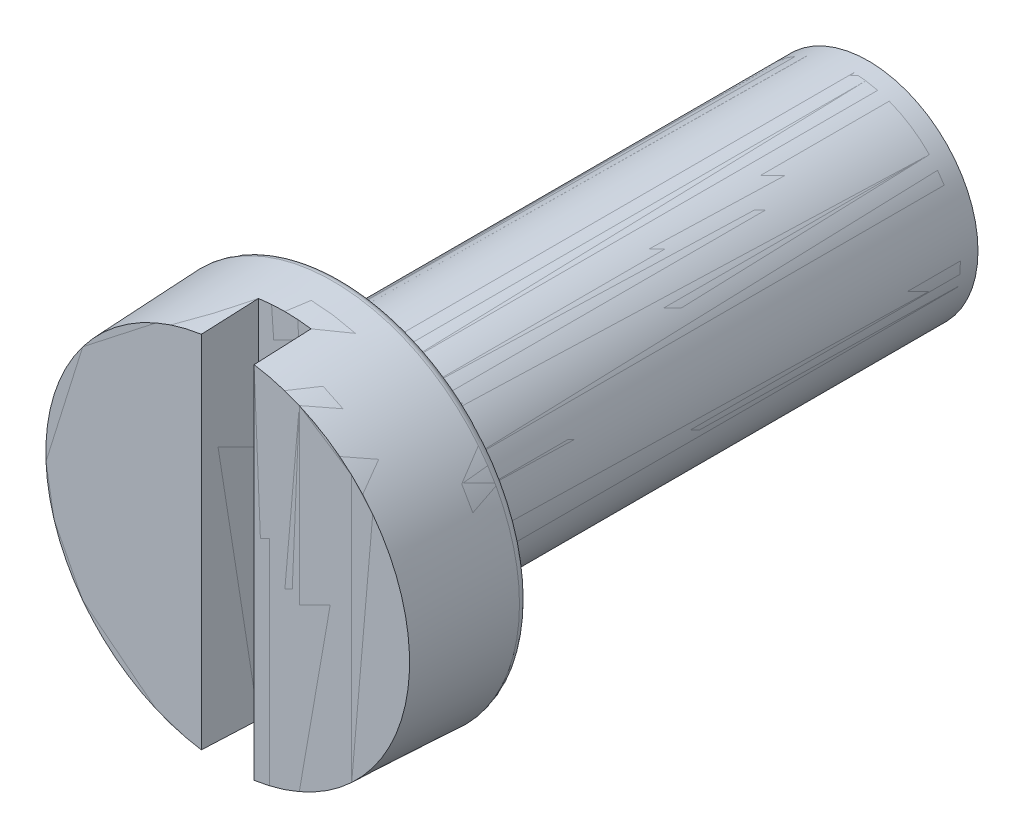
ISO-10303-21;
HEADER;
FILE_DESCRIPTION(('STEP AP214'),'2;1');
FILE_NAME('part.step','',(''),(''),'','','');
FILE_SCHEMA(('AUTOMOTIVE_DESIGN { 1 0 10303 214 1 1 1 1 }'));
ENDSEC;
DATA;
#1=APPLICATION_CONTEXT('core data for automotive mechanical design processes');
#2=APPLICATION_PROTOCOL_DEFINITION('international standard','automotive_design',2000,#1);
#3=PRODUCT_CONTEXT('',#1,'mechanical');
#4=PRODUCT('Part','Part','',(#3));
#5=PRODUCT_RELATED_PRODUCT_CATEGORY('part','',(#4));
#6=PRODUCT_DEFINITION_FORMATION('','',#4);
#7=PRODUCT_DEFINITION_CONTEXT('part definition',#1,'design');
#8=PRODUCT_DEFINITION('design','',#6,#7);
#9=PRODUCT_DEFINITION_SHAPE('','',#8);
#10=(LENGTH_UNIT() NAMED_UNIT(*) SI_UNIT(.MILLI.,.METRE.));
#11=(NAMED_UNIT(*) PLANE_ANGLE_UNIT() SI_UNIT($,.RADIAN.));
#12=(NAMED_UNIT(*) SI_UNIT($,.STERADIAN.) SOLID_ANGLE_UNIT());
#13=UNCERTAINTY_MEASURE_WITH_UNIT(LENGTH_MEASURE(1.E-05),#10,'distance_accuracy_value','');
#14=(GEOMETRIC_REPRESENTATION_CONTEXT(3) GLOBAL_UNCERTAINTY_ASSIGNED_CONTEXT((#13)) GLOBAL_UNIT_ASSIGNED_CONTEXT((#10,
#11,#12)) REPRESENTATION_CONTEXT('',''));
#15=CARTESIAN_POINT('',(0.,0.,0.));
#16=DIRECTION('',(0.,0.,1.));
#17=DIRECTION('',(1.,0.,0.));
#18=AXIS2_PLACEMENT_3D('',#15,#16,#17);
#19=CARTESIAN_POINT('',(0.,0.,2.6));
#20=DIRECTION('',(0.,0.,1.));
#21=DIRECTION('',(1.,0.,0.));
#22=AXIS2_PLACEMENT_3D('',#19,#20,#21);
#23=PLANE('',#22);
#24=DIRECTION('',(0.,1.,0.));
#25=VECTOR('',#24,1.);
#26=CARTESIAN_POINT('',(0.6,0.,2.6));
#27=LINE('',#26,#25);
#28=CARTESIAN_POINT('',(0.6,-4.10156030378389,2.6));
#29=VERTEX_POINT('',#28);
#30=CARTESIAN_POINT('',(0.6,4.10156030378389,2.6));
#31=VERTEX_POINT('',#30);
#32=EDGE_CURVE('P0_E51',#29,#31,#27,.T.);
#33=ORIENTED_EDGE('',*,*,#32,.F.);
#34=CARTESIAN_POINT('',(0.,0.,2.6));
#35=DIRECTION('',(0.,0.,1.));
#36=DIRECTION('',(1.,0.,0.));
#37=AXIS2_PLACEMENT_3D('',#34,#35,#36);
#38=CIRCLE('',#37,4.14521373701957);
#39=EDGE_CURVE('P0_E139',#29,#31,#38,.T.);
#40=ORIENTED_EDGE('',*,*,#39,.T.);
#41=EDGE_LOOP('',(#33,#40));
#42=FACE_BOUND('',#41,.T.);
#43=ADVANCED_FACE('P0_F28',(#42),#23,.T.);
#44=DIRECTION('',(0.,-1.,0.));
#45=VECTOR('',#44,1.);
#46=CARTESIAN_POINT('',(-0.6,0.,2.6));
#47=LINE('',#46,#45);
#48=CARTESIAN_POINT('',(-0.6,4.10156030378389,2.6));
#49=VERTEX_POINT('',#48);
#50=CARTESIAN_POINT('',(-0.6,-4.10156030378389,2.6));
#51=VERTEX_POINT('',#50);
#52=EDGE_CURVE('P0_E84',#49,#51,#47,.T.);
#53=ORIENTED_EDGE('',*,*,#52,.F.);
#54=EDGE_CURVE('P0_E90',#49,#51,#38,.T.);
#55=ORIENTED_EDGE('',*,*,#54,.T.);
#56=EDGE_LOOP('',(#53,#55));
#57=FACE_BOUND('',#56,.T.);
#58=ADVANCED_FACE('P0_F30',(#57),#23,.T.);
#59=CARTESIAN_POINT('',(0.,0.,-12.));
#60=DIRECTION('',(0.,0.,1.));
#61=DIRECTION('',(1.,0.,0.));
#62=AXIS2_PLACEMENT_3D('',#59,#60,#61);
#63=PLANE('',#62);
#64=CARTESIAN_POINT('',(0.,0.,-12.));
#65=DIRECTION('',(0.,0.,1.));
#66=DIRECTION('',(1.,0.,0.));
#67=AXIS2_PLACEMENT_3D('',#64,#65,#66);
#68=CIRCLE('',#67,2.1);
#69=CARTESIAN_POINT('',(2.1,0.,-12.));
#70=VERTEX_POINT('',#69);
#71=EDGE_CURVE('P0_E11',#70,#70,#68,.F.);
#72=ORIENTED_EDGE('',*,*,#71,.T.);
#73=EDGE_LOOP('',(#72));
#74=FACE_BOUND('',#73,.T.);
#75=ADVANCED_FACE('P0_F147',(#74),#63,.F.);
#76=CARTESIAN_POINT('',(0.,0.,0.));
#77=DIRECTION('',(0.,0.,1.));
#78=DIRECTION('',(1.,0.,0.));
#79=AXIS2_PLACEMENT_3D('',#76,#77,#78);
#80=CYLINDRICAL_SURFACE('',#79,2.5);
#81=CARTESIAN_POINT('',(0.,0.,-11.6));
#82=DIRECTION('',(0.,0.,1.));
#83=DIRECTION('',(1.,0.,0.));
#84=AXIS2_PLACEMENT_3D('',#81,#82,#83);
#85=CIRCLE('',#84,2.5);
#86=CARTESIAN_POINT('',(2.5,0.,-11.6));
#87=VERTEX_POINT('',#86);
#88=EDGE_CURVE('P0_E36',#87,#87,#85,.T.);
#89=ORIENTED_EDGE('',*,*,#88,.T.);
#90=EDGE_LOOP('',(#89));
#91=FACE_BOUND('',#90,.T.);
#92=CARTESIAN_POINT('',(0.,0.,-0.433));
#93=DIRECTION('',(0.,0.,1.));
#94=DIRECTION('',(1.,0.,0.));
#95=AXIS2_PLACEMENT_3D('',#92,#93,#94);
#96=CIRCLE('',#95,2.5);
#97=CARTESIAN_POINT('',(2.5,0.,-0.433));
#98=VERTEX_POINT('',#97);
#99=EDGE_CURVE('P0_E121',#98,#98,#96,.T.);
#100=ORIENTED_EDGE('',*,*,#99,.F.);
#101=EDGE_LOOP('',(#100));
#102=FACE_BOUND('',#101,.T.);
#103=ADVANCED_FACE('P0_F152',(#91,#102),#80,.T.);
#104=CARTESIAN_POINT('',(0.,0.,-0.433));
#105=DIRECTION('',(0.,0.,1.));
#106=DIRECTION('',(1.,0.,0.));
#107=AXIS2_PLACEMENT_3D('',#104,#105,#106);
#108=TOROIDAL_SURFACE('',#107,2.7,0.2);
#109=ORIENTED_EDGE('',*,*,#99,.T.);
#110=EDGE_LOOP('',(#109));
#111=FACE_BOUND('',#110,.T.);
#112=CARTESIAN_POINT('',(0.,0.,-0.324739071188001));
#113=DIRECTION('',(0.,0.,1.));
#114=DIRECTION('',(1.,0.,0.));
#115=AXIS2_PLACEMENT_3D('',#112,#113,#114);
#116=CIRCLE('',#115,2.5318346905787);
#117=CARTESIAN_POINT('',(2.5318346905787,0.,-0.324739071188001));
#118=VERTEX_POINT('',#117);
#119=EDGE_CURVE('P0_E124',#118,#118,#116,.T.);
#120=ORIENTED_EDGE('',*,*,#119,.F.);
#121=EDGE_LOOP('',(#120));
#122=FACE_BOUND('',#121,.T.);
#123=ADVANCED_FACE('P0_F185',(#111,#122),#108,.F.);
#124=CARTESIAN_POINT('',(0.,0.,-0.324739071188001));
#125=DIRECTION('',(0.,0.,1.));
#126=DIRECTION('',(1.,0.,0.));
#127=AXIS2_PLACEMENT_3D('',#124,#125,#126);
#128=CONICAL_SURFACE('',#127,2.5318346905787,0.571987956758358);
#129=CARTESIAN_POINT('',(0.,0.,-0.0917390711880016));
#130=DIRECTION('',(0.,0.,1.));
#131=DIRECTION('',(1.,0.,0.));
#132=AXIS2_PLACEMENT_3D('',#129,#130,#131);
#133=CIRCLE('',#132,2.68183469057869);
#134=CARTESIAN_POINT('',(2.68183469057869,0.,-0.0917390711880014));
#135=VERTEX_POINT('',#134);
#136=EDGE_CURVE('P0_E127',#135,#135,#133,.T.);
#137=ORIENTED_EDGE('',*,*,#136,.F.);
#138=EDGE_LOOP('',(#137));
#139=FACE_BOUND('',#138,.T.);
#140=ORIENTED_EDGE('',*,*,#119,.T.);
#141=EDGE_LOOP('',(#140));
#142=FACE_BOUND('',#141,.T.);
#143=ADVANCED_FACE('P0_F181',(#139,#142),#128,.T.);
#144=CARTESIAN_POINT('',(0.,0.,-0.2));
#145=DIRECTION('',(0.,0.,1.));
#146=DIRECTION('',(1.,0.,0.));
#147=AXIS2_PLACEMENT_3D('',#144,#145,#146);
#148=TOROIDAL_SURFACE('',#147,2.85,0.2);
#149=ORIENTED_EDGE('',*,*,#136,.T.);
#150=EDGE_LOOP('',(#149));
#151=FACE_BOUND('',#150,.T.);
#152=CARTESIAN_POINT('',(0.,0.,0.));
#153=DIRECTION('',(0.,0.,1.));
#154=DIRECTION('',(1.,0.,0.));
#155=AXIS2_PLACEMENT_3D('',#152,#153,#154);
#156=CIRCLE('',#155,2.85);
#157=CARTESIAN_POINT('',(2.85,0.,0.));
#158=VERTEX_POINT('',#157);
#159=EDGE_CURVE('P0_E130',#158,#158,#156,.T.);
#160=ORIENTED_EDGE('',*,*,#159,.F.);
#161=EDGE_LOOP('',(#160));
#162=FACE_BOUND('',#161,.T.);
#163=ADVANCED_FACE('P0_F173',(#151,#162),#148,.F.);
#164=CARTESIAN_POINT('',(0.,2.85,0.));
#165=DIRECTION('',(0.,0.,1.));
#166=DIRECTION('',(1.,0.,0.));
#167=AXIS2_PLACEMENT_3D('',#164,#165,#166);
#168=PLANE('',#167);
#169=CARTESIAN_POINT('',(0.,0.,0.));
#170=DIRECTION('',(0.,0.,1.));
#171=DIRECTION('',(1.,0.,0.));
#172=AXIS2_PLACEMENT_3D('',#169,#170,#171);
#173=CIRCLE('',#172,4.05);
#174=CARTESIAN_POINT('',(4.05,0.,0.));
#175=VERTEX_POINT('',#174);
#176=EDGE_CURVE('P0_E133',#175,#175,#173,.T.);
#177=ORIENTED_EDGE('',*,*,#176,.F.);
#178=EDGE_LOOP('',(#177));
#179=FACE_BOUND('',#178,.T.);
#180=ORIENTED_EDGE('',*,*,#159,.T.);
#181=EDGE_LOOP('',(#180));
#182=FACE_BOUND('',#181,.T.);
#183=ADVANCED_FACE('P0_F168',(#179,#182),#168,.F.);
#184=CARTESIAN_POINT('',(0.,0.,0.2));
#185=DIRECTION('',(0.,0.,1.));
#186=DIRECTION('',(1.,0.,0.));
#187=AXIS2_PLACEMENT_3D('',#184,#185,#186);
#188=TOROIDAL_SURFACE('',#187,4.05,0.2);
#189=CARTESIAN_POINT('',(0.,0.,0.2));
#190=DIRECTION('',(0.,0.,1.));
#191=DIRECTION('',(1.,0.,0.));
#192=AXIS2_PLACEMENT_3D('',#189,#190,#191);
#193=CIRCLE('',#192,4.25);
#194=CARTESIAN_POINT('',(4.25,0.,0.2));
#195=VERTEX_POINT('',#194);
#196=EDGE_CURVE('P0_E136',#195,#195,#193,.T.);
#197=ORIENTED_EDGE('',*,*,#196,.F.);
#198=EDGE_LOOP('',(#197));
#199=FACE_BOUND('',#198,.T.);
#200=ORIENTED_EDGE('',*,*,#176,.T.);
#201=EDGE_LOOP('',(#200));
#202=FACE_BOUND('',#201,.T.);
#203=ADVANCED_FACE('P0_F162',(#199,#202),#188,.T.);
#204=CARTESIAN_POINT('',(0.,0.,0.2));
#205=DIRECTION('',(0.,0.,-1.));
#206=DIRECTION('',(-1.,0.,0.));
#207=AXIS2_PLACEMENT_3D('',#204,#205,#206);
#208=CONICAL_SURFACE('',#207,4.25,0.0436332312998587);
#209=CARTESIAN_POINT('',(0.,0.,1.3));
#210=DIRECTION('',(0.,0.,-1.));
#211=DIRECTION('',(-1.,0.,0.));
#212=AXIS2_PLACEMENT_3D('',#209,#210,#211);
#213=CIRCLE('',#212,4.20197296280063);
#214=CARTESIAN_POINT('',(-0.6,4.1589153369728,1.3));
#215=VERTEX_POINT('',#214);
#216=CARTESIAN_POINT('',(0.6,4.1589153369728,1.3));
#217=VERTEX_POINT('',#216);
#218=EDGE_CURVE('P0_E68',#215,#217,#213,.T.);
#219=ORIENTED_EDGE('',*,*,#218,.T.);
#220=CARTESIAN_POINT('',(0.6,4.48049536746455,-5.99526208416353));
#221=CARTESIAN_POINT('',(0.6,4.3632332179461,-3.33290690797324));
#222=CARTESIAN_POINT('',(0.6,4.24586680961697,-0.67055633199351));
#223=CARTESIAN_POINT('',(0.6,4.01092547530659,4.65413562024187));
#224=CARTESIAN_POINT('',(0.6,3.89335054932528,7.31647699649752));
#225=CARTESIAN_POINT('',(0.6,3.77567136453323,9.97881377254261));
#226=B_SPLINE_CURVE_WITH_KNOTS('',3,(#220,#221,#222,#223,#224,#225),.UNSPECIFIED.,.F.,.F.,(4,2,
4),(0.,7.99480888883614,15.9896177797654),.UNSPECIFIED.);
#227=EDGE_CURVE('P0_E91',#217,#31,#226,.T.);
#228=ORIENTED_EDGE('',*,*,#227,.T.);
#229=ORIENTED_EDGE('',*,*,#39,.F.);
#230=CARTESIAN_POINT('',(0.6,-3.77567136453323,9.97881377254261));
#231=CARTESIAN_POINT('',(0.6,-3.89335054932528,7.31647699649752));
#232=CARTESIAN_POINT('',(0.6,-4.01092547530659,4.65413562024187));
#233=CARTESIAN_POINT('',(0.6,-4.24586680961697,-0.67055633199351));
#234=CARTESIAN_POINT('',(0.6,-4.3632332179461,-3.33290690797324));
#235=CARTESIAN_POINT('',(0.6,-4.48049536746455,-5.99526208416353));
#236=B_SPLINE_CURVE_WITH_KNOTS('',3,(#230,#231,#232,#233,#234,#235),.UNSPECIFIED.,.F.,.F.,(4,2,
4),(0.,7.99480889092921,15.9896177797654),.UNSPECIFIED.);
#237=CARTESIAN_POINT('',(0.6,-4.1589153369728,1.3));
#238=VERTEX_POINT('',#237);
#239=EDGE_CURVE('P0_E75',#29,#238,#236,.T.);
#240=ORIENTED_EDGE('',*,*,#239,.T.);
#241=CARTESIAN_POINT('',(-0.6,-4.1589153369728,1.3));
#242=VERTEX_POINT('',#241);
#243=EDGE_CURVE('P0_E77',#238,#242,#213,.T.);
#244=ORIENTED_EDGE('',*,*,#243,.T.);
#245=CARTESIAN_POINT('',(-0.6,-4.48049536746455,-5.99526208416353));
#246=CARTESIAN_POINT('',(-0.6,-4.3632332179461,-3.33290690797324));
#247=CARTESIAN_POINT('',(-0.6,-4.24586680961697,-0.67055633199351));
#248=CARTESIAN_POINT('',(-0.6,-4.01092547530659,4.65413562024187));
#249=CARTESIAN_POINT('',(-0.6,-3.89335054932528,7.31647699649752));
#250=CARTESIAN_POINT('',(-0.6,-3.77567136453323,9.97881377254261));
#251=B_SPLINE_CURVE_WITH_KNOTS('',3,(#245,#246,#247,#248,#249,#250),.UNSPECIFIED.,.F.,.F.,(4,2,
4),(0.,7.99480888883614,15.9896177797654),.UNSPECIFIED.);
#252=EDGE_CURVE('P0_E82',#242,#51,#251,.T.);
#253=ORIENTED_EDGE('',*,*,#252,.T.);
#254=ORIENTED_EDGE('',*,*,#54,.F.);
#255=CARTESIAN_POINT('',(-0.6,3.77567136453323,9.97881377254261));
#256=CARTESIAN_POINT('',(-0.6,3.89335054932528,7.31647699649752));
#257=CARTESIAN_POINT('',(-0.6,4.01092547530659,4.65413562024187));
#258=CARTESIAN_POINT('',(-0.6,4.24586680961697,-0.67055633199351));
#259=CARTESIAN_POINT('',(-0.6,4.3632332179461,-3.33290690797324));
#260=CARTESIAN_POINT('',(-0.6,4.48049536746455,-5.99526208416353));
#261=B_SPLINE_CURVE_WITH_KNOTS('',3,(#255,#256,#257,#258,#259,#260),.UNSPECIFIED.,.F.,.F.,(4,2,
4),(0.,7.99480889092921,15.9896177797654),.UNSPECIFIED.);
#262=EDGE_CURVE('P0_E74',#49,#215,#261,.T.);
#263=ORIENTED_EDGE('',*,*,#262,.T.);
#264=EDGE_LOOP('',(#219,#228,#229,#240,#244,#253,#254,#263));
#265=FACE_BOUND('',#264,.T.);
#266=ORIENTED_EDGE('',*,*,#196,.T.);
#267=EDGE_LOOP('',(#266));
#268=FACE_BOUND('',#267,.T.);
#269=ADVANCED_FACE('P0_F87',(#265,#268),#208,.T.);
#270=CARTESIAN_POINT('',(0.6,0.,1.95));
#271=DIRECTION('',(1.,0.,0.));
#272=DIRECTION('',(0.,0.,-1.));
#273=AXIS2_PLACEMENT_3D('',#270,#271,#272);
#274=PLANE('',#273);
#275=ORIENTED_EDGE('',*,*,#32,.T.);
#276=ORIENTED_EDGE('',*,*,#227,.F.);
#277=DIRECTION('',(0.,-1.,0.));
#278=VECTOR('',#277,1.);
#279=CARTESIAN_POINT('',(0.6,0.,1.3));
#280=LINE('',#279,#278);
#281=EDGE_CURVE('P0_E71',#217,#238,#280,.T.);
#282=ORIENTED_EDGE('',*,*,#281,.T.);
#283=ORIENTED_EDGE('',*,*,#239,.F.);
#284=EDGE_LOOP('',(#275,#276,#282,#283));
#285=FACE_BOUND('',#284,.T.);
#286=ADVANCED_FACE('P0_F114',(#285),#274,.F.);
#287=CARTESIAN_POINT('',(-0.6,0.,1.95));
#288=DIRECTION('',(-1.,0.,0.));
#289=DIRECTION('',(0.,0.,1.));
#290=AXIS2_PLACEMENT_3D('',#287,#288,#289);
#291=PLANE('',#290);
#292=DIRECTION('',(0.,1.,0.));
#293=VECTOR('',#292,1.);
#294=CARTESIAN_POINT('',(-0.6,0.,1.3));
#295=LINE('',#294,#293);
#296=EDGE_CURVE('P0_E43',#242,#215,#295,.T.);
#297=ORIENTED_EDGE('',*,*,#296,.T.);
#298=ORIENTED_EDGE('',*,*,#262,.F.);
#299=ORIENTED_EDGE('',*,*,#52,.T.);
#300=ORIENTED_EDGE('',*,*,#252,.F.);
#301=EDGE_LOOP('',(#297,#298,#299,#300));
#302=FACE_BOUND('',#301,.T.);
#303=ADVANCED_FACE('P0_F79',(#302),#291,.F.);
#304=CARTESIAN_POINT('',(-0.6,0.,1.3));
#305=DIRECTION('',(0.,0.,-1.));
#306=DIRECTION('',(-1.,0.,0.));
#307=AXIS2_PLACEMENT_3D('',#304,#305,#306);
#308=PLANE('',#307);
#309=ORIENTED_EDGE('',*,*,#296,.F.);
#310=ORIENTED_EDGE('',*,*,#243,.F.);
#311=ORIENTED_EDGE('',*,*,#281,.F.);
#312=ORIENTED_EDGE('',*,*,#218,.F.);
#313=EDGE_LOOP('',(#309,#310,#311,#312));
#314=FACE_BOUND('',#313,.T.);
#315=ADVANCED_FACE('P0_F69',(#314),#308,.F.);
#316=CARTESIAN_POINT('',(0.,0.,-11.6));
#317=DIRECTION('',(0.,0.,1.));
#318=DIRECTION('',(1.,0.,0.));
#319=AXIS2_PLACEMENT_3D('',#316,#317,#318);
#320=CONICAL_SURFACE('',#319,2.5,0.785398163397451);
#321=ORIENTED_EDGE('',*,*,#71,.F.);
#322=EDGE_LOOP('',(#321));
#323=FACE_BOUND('',#322,.T.);
#324=ORIENTED_EDGE('',*,*,#88,.F.);
#325=EDGE_LOOP('',(#324));
#326=FACE_BOUND('',#325,.T.);
#327=ADVANCED_FACE('P0_F115',(#323,#326),#320,.T.);
#328=CLOSED_SHELL('',(#43,#58,#75,#103,#123,#143,#163,#183,#203,#269,#286,#303,#315,#327));
#329=MANIFOLD_SOLID_BREP('P0_B2',#328);
#330=CARTESIAN_POINT('',(0.,0.,2.6));
#331=DIRECTION('',(0.,0.,1.));
#332=DIRECTION('',(1.,0.,0.));
#333=AXIS2_PLACEMENT_3D('',#330,#331,#332);
#334=PLANE('',#333);
#335=DIRECTION('',(0.,1.,0.));
#336=VECTOR('',#335,1.);
#337=CARTESIAN_POINT('',(0.6,0.,2.6));
#338=LINE('',#337,#336);
#339=CARTESIAN_POINT('',(0.6,-4.10156030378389,2.6));
#340=VERTEX_POINT('',#339);
#341=CARTESIAN_POINT('',(0.6,4.10156030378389,2.6));
#342=VERTEX_POINT('',#341);
#343=EDGE_CURVE('P1_E44',#340,#342,#338,.T.);
#344=ORIENTED_EDGE('',*,*,#343,.F.);
#345=CARTESIAN_POINT('',(0.,0.,2.6));
#346=DIRECTION('',(0.,0.,1.));
#347=DIRECTION('',(1.,0.,0.));
#348=AXIS2_PLACEMENT_3D('',#345,#346,#347);
#349=CIRCLE('',#348,4.14521373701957);
#350=EDGE_CURVE('P1_E123',#340,#342,#349,.T.);
#351=ORIENTED_EDGE('',*,*,#350,.T.);
#352=EDGE_LOOP('',(#344,#351));
#353=FACE_BOUND('',#352,.T.);
#354=ADVANCED_FACE('P1_F16',(#353),#334,.T.);
#355=DIRECTION('',(0.,-1.,0.));
#356=VECTOR('',#355,1.);
#357=CARTESIAN_POINT('',(-0.6,0.,2.6));
#358=LINE('',#357,#356);
#359=CARTESIAN_POINT('',(-0.6,4.10156030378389,2.6));
#360=VERTEX_POINT('',#359);
#361=CARTESIAN_POINT('',(-0.6,-4.10156030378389,2.6));
#362=VERTEX_POINT('',#361);
#363=EDGE_CURVE('P1_E75',#360,#362,#358,.T.);
#364=ORIENTED_EDGE('',*,*,#363,.F.);
#365=EDGE_CURVE('P1_E81',#360,#362,#349,.T.);
#366=ORIENTED_EDGE('',*,*,#365,.T.);
#367=EDGE_LOOP('',(#364,#366));
#368=FACE_BOUND('',#367,.T.);
#369=ADVANCED_FACE('P1_F18',(#368),#334,.T.);
#370=CARTESIAN_POINT('',(0.,0.,-12.));
#371=DIRECTION('',(0.,0.,1.));
#372=DIRECTION('',(1.,0.,0.));
#373=AXIS2_PLACEMENT_3D('',#370,#371,#372);
#374=PLANE('',#373);
#375=CARTESIAN_POINT('',(0.,0.,-12.));
#376=DIRECTION('',(0.,0.,1.));
#377=DIRECTION('',(1.,0.,0.));
#378=AXIS2_PLACEMENT_3D('',#375,#376,#377);
#379=CIRCLE('',#378,2.5);
#380=CARTESIAN_POINT('',(2.5,0.,-12.));
#381=VERTEX_POINT('',#380);
#382=EDGE_CURVE('P1_E102',#381,#381,#379,.T.);
#383=ORIENTED_EDGE('',*,*,#382,.F.);
#384=EDGE_LOOP('',(#383));
#385=FACE_BOUND('',#384,.T.);
#386=ADVANCED_FACE('P1_F131',(#385),#374,.F.);
#387=CARTESIAN_POINT('',(0.,0.,0.));
#388=DIRECTION('',(0.,0.,1.));
#389=DIRECTION('',(1.,0.,0.));
#390=AXIS2_PLACEMENT_3D('',#387,#388,#389);
#391=CYLINDRICAL_SURFACE('',#390,2.5);
#392=CARTESIAN_POINT('',(0.,0.,-0.433));
#393=DIRECTION('',(0.,0.,1.));
#394=DIRECTION('',(1.,0.,0.));
#395=AXIS2_PLACEMENT_3D('',#392,#393,#394);
#396=CIRCLE('',#395,2.5);
#397=CARTESIAN_POINT('',(2.5,0.,-0.433));
#398=VERTEX_POINT('',#397);
#399=EDGE_CURVE('P1_E105',#398,#398,#396,.T.);
#400=ORIENTED_EDGE('',*,*,#399,.F.);
#401=EDGE_LOOP('',(#400));
#402=FACE_BOUND('',#401,.T.);
#403=ORIENTED_EDGE('',*,*,#382,.T.);
#404=EDGE_LOOP('',(#403));
#405=FACE_BOUND('',#404,.T.);
#406=ADVANCED_FACE('P1_F137',(#402,#405),#391,.T.);
#407=CARTESIAN_POINT('',(0.,0.,-0.433));
#408=DIRECTION('',(0.,0.,1.));
#409=DIRECTION('',(1.,0.,0.));
#410=AXIS2_PLACEMENT_3D('',#407,#408,#409);
#411=TOROIDAL_SURFACE('',#410,2.7,0.2);
#412=ORIENTED_EDGE('',*,*,#399,.T.);
#413=EDGE_LOOP('',(#412));
#414=FACE_BOUND('',#413,.T.);
#415=CARTESIAN_POINT('',(0.,0.,-0.324739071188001));
#416=DIRECTION('',(0.,0.,1.));
#417=DIRECTION('',(1.,0.,0.));
#418=AXIS2_PLACEMENT_3D('',#415,#416,#417);
#419=CIRCLE('',#418,2.5318346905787);
#420=CARTESIAN_POINT('',(2.5318346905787,0.,-0.324739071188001));
#421=VERTEX_POINT('',#420);
#422=EDGE_CURVE('P1_E108',#421,#421,#419,.T.);
#423=ORIENTED_EDGE('',*,*,#422,.F.);
#424=EDGE_LOOP('',(#423));
#425=FACE_BOUND('',#424,.T.);
#426=ADVANCED_FACE('P1_F170',(#414,#425),#411,.F.);
#427=CARTESIAN_POINT('',(0.,0.,-0.324739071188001));
#428=DIRECTION('',(0.,0.,1.));
#429=DIRECTION('',(1.,0.,0.));
#430=AXIS2_PLACEMENT_3D('',#427,#428,#429);
#431=CONICAL_SURFACE('',#430,2.5318346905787,0.571987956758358);
#432=CARTESIAN_POINT('',(0.,0.,-0.0917390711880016));
#433=DIRECTION('',(0.,0.,1.));
#434=DIRECTION('',(1.,0.,0.));
#435=AXIS2_PLACEMENT_3D('',#432,#433,#434);
#436=CIRCLE('',#435,2.68183469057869);
#437=CARTESIAN_POINT('',(2.68183469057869,0.,-0.0917390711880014));
#438=VERTEX_POINT('',#437);
#439=EDGE_CURVE('P1_E111',#438,#438,#436,.T.);
#440=ORIENTED_EDGE('',*,*,#439,.F.);
#441=EDGE_LOOP('',(#440));
#442=FACE_BOUND('',#441,.T.);
#443=ORIENTED_EDGE('',*,*,#422,.T.);
#444=EDGE_LOOP('',(#443));
#445=FACE_BOUND('',#444,.T.);
#446=ADVANCED_FACE('P1_F166',(#442,#445),#431,.T.);
#447=CARTESIAN_POINT('',(0.,0.,-0.2));
#448=DIRECTION('',(0.,0.,1.));
#449=DIRECTION('',(1.,0.,0.));
#450=AXIS2_PLACEMENT_3D('',#447,#448,#449);
#451=TOROIDAL_SURFACE('',#450,2.85,0.2);
#452=ORIENTED_EDGE('',*,*,#439,.T.);
#453=EDGE_LOOP('',(#452));
#454=FACE_BOUND('',#453,.T.);
#455=CARTESIAN_POINT('',(0.,0.,0.));
#456=DIRECTION('',(0.,0.,1.));
#457=DIRECTION('',(1.,0.,0.));
#458=AXIS2_PLACEMENT_3D('',#455,#456,#457);
#459=CIRCLE('',#458,2.85);
#460=CARTESIAN_POINT('',(2.85,0.,0.));
#461=VERTEX_POINT('',#460);
#462=EDGE_CURVE('P1_E114',#461,#461,#459,.T.);
#463=ORIENTED_EDGE('',*,*,#462,.F.);
#464=EDGE_LOOP('',(#463));
#465=FACE_BOUND('',#464,.T.);
#466=ADVANCED_FACE('P1_F158',(#454,#465),#451,.F.);
#467=CARTESIAN_POINT('',(0.,2.85,0.));
#468=DIRECTION('',(0.,0.,1.));
#469=DIRECTION('',(1.,0.,0.));
#470=AXIS2_PLACEMENT_3D('',#467,#468,#469);
#471=PLANE('',#470);
#472=CARTESIAN_POINT('',(0.,0.,0.));
#473=DIRECTION('',(0.,0.,1.));
#474=DIRECTION('',(1.,0.,0.));
#475=AXIS2_PLACEMENT_3D('',#472,#473,#474);
#476=CIRCLE('',#475,4.05);
#477=CARTESIAN_POINT('',(4.05,0.,0.));
#478=VERTEX_POINT('',#477);
#479=EDGE_CURVE('P1_E117',#478,#478,#476,.T.);
#480=ORIENTED_EDGE('',*,*,#479,.F.);
#481=EDGE_LOOP('',(#480));
#482=FACE_BOUND('',#481,.T.);
#483=ORIENTED_EDGE('',*,*,#462,.T.);
#484=EDGE_LOOP('',(#483));
#485=FACE_BOUND('',#484,.T.);
#486=ADVANCED_FACE('P1_F153',(#482,#485),#471,.F.);
#487=CARTESIAN_POINT('',(0.,0.,0.2));
#488=DIRECTION('',(0.,0.,1.));
#489=DIRECTION('',(1.,0.,0.));
#490=AXIS2_PLACEMENT_3D('',#487,#488,#489);
#491=TOROIDAL_SURFACE('',#490,4.05,0.2);
#492=CARTESIAN_POINT('',(0.,0.,0.2));
#493=DIRECTION('',(0.,0.,1.));
#494=DIRECTION('',(1.,0.,0.));
#495=AXIS2_PLACEMENT_3D('',#492,#493,#494);
#496=CIRCLE('',#495,4.25);
#497=CARTESIAN_POINT('',(4.25,0.,0.2));
#498=VERTEX_POINT('',#497);
#499=EDGE_CURVE('P1_E120',#498,#498,#496,.T.);
#500=ORIENTED_EDGE('',*,*,#499,.F.);
#501=EDGE_LOOP('',(#500));
#502=FACE_BOUND('',#501,.T.);
#503=ORIENTED_EDGE('',*,*,#479,.T.);
#504=EDGE_LOOP('',(#503));
#505=FACE_BOUND('',#504,.T.);
#506=ADVANCED_FACE('P1_F147',(#502,#505),#491,.T.);
#507=CARTESIAN_POINT('',(0.,0.,0.2));
#508=DIRECTION('',(0.,0.,-1.));
#509=DIRECTION('',(-1.,0.,0.));
#510=AXIS2_PLACEMENT_3D('',#507,#508,#509);
#511=CONICAL_SURFACE('',#510,4.25,0.0436332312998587);
#512=CARTESIAN_POINT('',(0.,0.,1.3));
#513=DIRECTION('',(0.,0.,-1.));
#514=DIRECTION('',(-1.,0.,0.));
#515=AXIS2_PLACEMENT_3D('',#512,#513,#514);
#516=CIRCLE('',#515,4.20197296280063);
#517=CARTESIAN_POINT('',(-0.6,4.1589153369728,1.3));
#518=VERTEX_POINT('',#517);
#519=CARTESIAN_POINT('',(0.6,4.1589153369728,1.3));
#520=VERTEX_POINT('',#519);
#521=EDGE_CURVE('P1_E60',#518,#520,#516,.T.);
#522=ORIENTED_EDGE('',*,*,#521,.T.);
#523=CARTESIAN_POINT('',(0.6,4.48049536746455,-5.99526208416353));
#524=CARTESIAN_POINT('',(0.6,4.3632332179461,-3.33290690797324));
#525=CARTESIAN_POINT('',(0.6,4.24586680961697,-0.67055633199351));
#526=CARTESIAN_POINT('',(0.6,4.01092547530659,4.65413562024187));
#527=CARTESIAN_POINT('',(0.6,3.89335054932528,7.31647699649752));
#528=CARTESIAN_POINT('',(0.6,3.77567136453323,9.97881377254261));
#529=B_SPLINE_CURVE_WITH_KNOTS('',3,(#523,#524,#525,#526,#527,#528),.UNSPECIFIED.,.F.,.F.,(4,2,
4),(0.,7.99480888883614,15.9896177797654),.UNSPECIFIED.);
#530=EDGE_CURVE('P1_E11',#520,#342,#529,.T.);
#531=ORIENTED_EDGE('',*,*,#530,.T.);
#532=ORIENTED_EDGE('',*,*,#350,.F.);
#533=CARTESIAN_POINT('',(0.6,-3.77567136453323,9.97881377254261));
#534=CARTESIAN_POINT('',(0.6,-3.89335054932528,7.31647699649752));
#535=CARTESIAN_POINT('',(0.6,-4.01092547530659,4.65413562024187));
#536=CARTESIAN_POINT('',(0.6,-4.24586680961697,-0.67055633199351));
#537=CARTESIAN_POINT('',(0.6,-4.3632332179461,-3.33290690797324));
#538=CARTESIAN_POINT('',(0.6,-4.48049536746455,-5.99526208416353));
#539=B_SPLINE_CURVE_WITH_KNOTS('',3,(#533,#534,#535,#536,#537,#538),.UNSPECIFIED.,.F.,.F.,(4,2,
4),(0.,7.99480889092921,15.9896177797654),.UNSPECIFIED.);
#540=CARTESIAN_POINT('',(0.6,-4.1589153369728,1.3));
#541=VERTEX_POINT('',#540);
#542=EDGE_CURVE('P1_E66',#340,#541,#539,.T.);
#543=ORIENTED_EDGE('',*,*,#542,.T.);
#544=CARTESIAN_POINT('',(-0.6,-4.1589153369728,1.3));
#545=VERTEX_POINT('',#544);
#546=EDGE_CURVE('P1_E68',#541,#545,#516,.T.);
#547=ORIENTED_EDGE('',*,*,#546,.T.);
#548=CARTESIAN_POINT('',(-0.6,-4.48049536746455,-5.99526208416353));
#549=CARTESIAN_POINT('',(-0.6,-4.3632332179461,-3.33290690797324));
#550=CARTESIAN_POINT('',(-0.6,-4.24586680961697,-0.67055633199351));
#551=CARTESIAN_POINT('',(-0.6,-4.01092547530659,4.65413562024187));
#552=CARTESIAN_POINT('',(-0.6,-3.89335054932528,7.31647699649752));
#553=CARTESIAN_POINT('',(-0.6,-3.77567136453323,9.97881377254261));
#554=B_SPLINE_CURVE_WITH_KNOTS('',3,(#548,#549,#550,#551,#552,#553),.UNSPECIFIED.,.F.,.F.,(4,2,
4),(0.,7.99480888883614,15.9896177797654),.UNSPECIFIED.);
#555=EDGE_CURVE('P1_E73',#545,#362,#554,.T.);
#556=ORIENTED_EDGE('',*,*,#555,.T.);
#557=ORIENTED_EDGE('',*,*,#365,.F.);
#558=CARTESIAN_POINT('',(-0.6,3.77567136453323,9.97881377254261));
#559=CARTESIAN_POINT('',(-0.6,3.89335054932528,7.31647699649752));
#560=CARTESIAN_POINT('',(-0.6,4.01092547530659,4.65413562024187));
#561=CARTESIAN_POINT('',(-0.6,4.24586680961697,-0.67055633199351));
#562=CARTESIAN_POINT('',(-0.6,4.3632332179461,-3.33290690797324));
#563=CARTESIAN_POINT('',(-0.6,4.48049536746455,-5.99526208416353));
#564=B_SPLINE_CURVE_WITH_KNOTS('',3,(#558,#559,#560,#561,#562,#563),.UNSPECIFIED.,.F.,.F.,(4,2,
4),(0.,7.99480889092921,15.9896177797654),.UNSPECIFIED.);
#565=EDGE_CURVE('P1_E29',#360,#518,#564,.T.);
#566=ORIENTED_EDGE('',*,*,#565,.T.);
#567=EDGE_LOOP('',(#522,#531,#532,#543,#547,#556,#557,#566));
#568=FACE_BOUND('',#567,.T.);
#569=ORIENTED_EDGE('',*,*,#499,.T.);
#570=EDGE_LOOP('',(#569));
#571=FACE_BOUND('',#570,.T.);
#572=ADVANCED_FACE('P1_F78',(#568,#571),#511,.T.);
#573=CARTESIAN_POINT('',(0.6,0.,1.95));
#574=DIRECTION('',(1.,0.,0.));
#575=DIRECTION('',(0.,0.,-1.));
#576=AXIS2_PLACEMENT_3D('',#573,#574,#575);
#577=PLANE('',#576);
#578=ORIENTED_EDGE('',*,*,#343,.T.);
#579=ORIENTED_EDGE('',*,*,#530,.F.);
#580=DIRECTION('',(0.,-1.,0.));
#581=VECTOR('',#580,1.);
#582=CARTESIAN_POINT('',(0.6,0.,1.3));
#583=LINE('',#582,#581);
#584=EDGE_CURVE('P1_E63',#520,#541,#583,.T.);
#585=ORIENTED_EDGE('',*,*,#584,.T.);
#586=ORIENTED_EDGE('',*,*,#542,.F.);
#587=EDGE_LOOP('',(#578,#579,#585,#586));
#588=FACE_BOUND('',#587,.T.);
#589=ADVANCED_FACE('P1_F96',(#588),#577,.F.);
#590=CARTESIAN_POINT('',(-0.6,0.,1.95));
#591=DIRECTION('',(-1.,0.,0.));
#592=DIRECTION('',(0.,0.,1.));
#593=AXIS2_PLACEMENT_3D('',#590,#591,#592);
#594=PLANE('',#593);
#595=DIRECTION('',(0.,1.,0.));
#596=VECTOR('',#595,1.);
#597=CARTESIAN_POINT('',(-0.6,0.,1.3));
#598=LINE('',#597,#596);
#599=EDGE_CURVE('P1_E36',#545,#518,#598,.T.);
#600=ORIENTED_EDGE('',*,*,#599,.T.);
#601=ORIENTED_EDGE('',*,*,#565,.F.);
#602=ORIENTED_EDGE('',*,*,#363,.T.);
#603=ORIENTED_EDGE('',*,*,#555,.F.);
#604=EDGE_LOOP('',(#600,#601,#602,#603));
#605=FACE_BOUND('',#604,.T.);
#606=ADVANCED_FACE('P1_F70',(#605),#594,.F.);
#607=CARTESIAN_POINT('',(-0.6,0.,1.3));
#608=DIRECTION('',(0.,0.,-1.));
#609=DIRECTION('',(-1.,0.,0.));
#610=AXIS2_PLACEMENT_3D('',#607,#608,#609);
#611=PLANE('',#610);
#612=ORIENTED_EDGE('',*,*,#599,.F.);
#613=ORIENTED_EDGE('',*,*,#546,.F.);
#614=ORIENTED_EDGE('',*,*,#584,.F.);
#615=ORIENTED_EDGE('',*,*,#521,.F.);
#616=EDGE_LOOP('',(#612,#613,#614,#615));
#617=FACE_BOUND('',#616,.T.);
#618=ADVANCED_FACE('P1_F61',(#617),#611,.F.);
#619=CLOSED_SHELL('',(#354,#369,#386,#406,#426,#446,#466,#486,#506,#572,#589,#606,#618));
#620=MANIFOLD_SOLID_BREP('P1_B1',#619);
#621=ADVANCED_BREP_SHAPE_REPRESENTATION('',(#18,#329,#620),#14);
#622=SHAPE_DEFINITION_REPRESENTATION(#9,#621);
ENDSEC;
END-ISO-10303-21;
